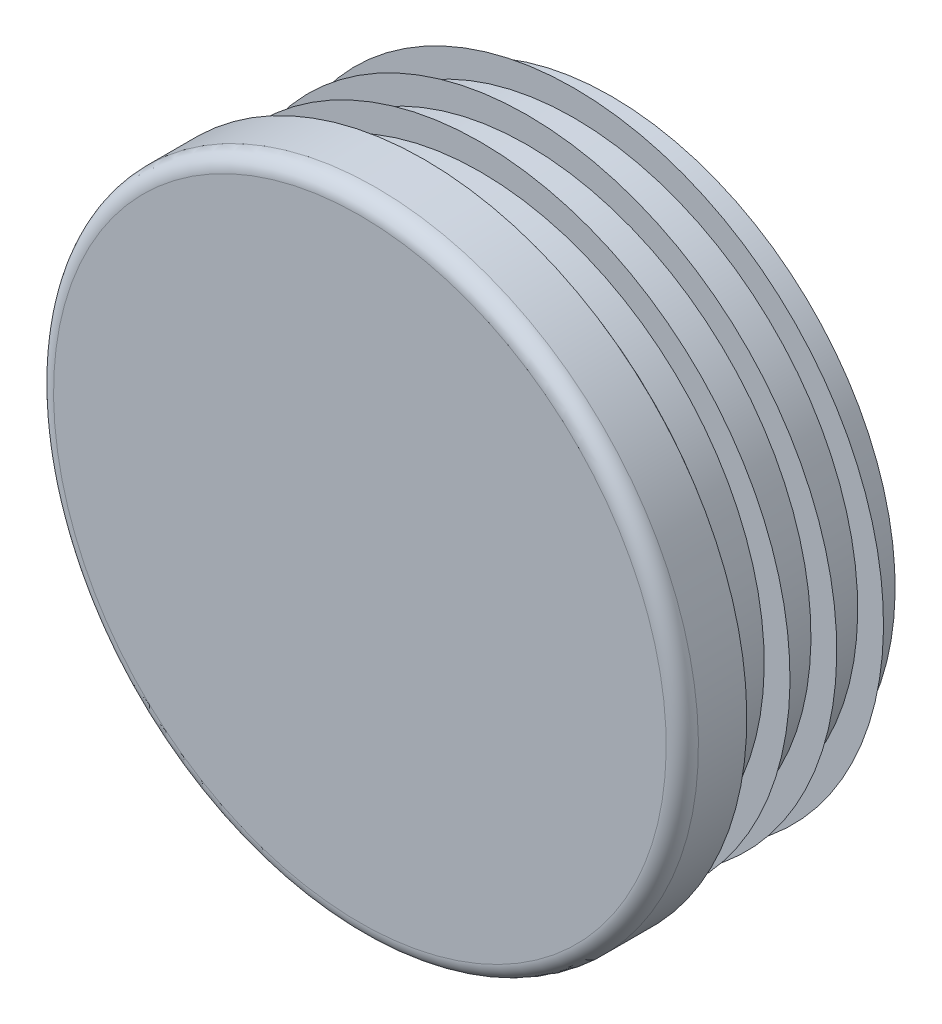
ISO-10303-21;
HEADER;
FILE_DESCRIPTION(('STEP AP214'),'2;1');
FILE_NAME('part.step','',(''),(''),'','','');
FILE_SCHEMA(('AUTOMOTIVE_DESIGN { 1 0 10303 214 1 1 1 1 }'));
ENDSEC;
DATA;
#1=APPLICATION_CONTEXT('core data for automotive mechanical design processes');
#2=APPLICATION_PROTOCOL_DEFINITION('international standard','automotive_design',2000,#1);
#3=PRODUCT_CONTEXT('',#1,'mechanical');
#4=PRODUCT('Part','Part','',(#3));
#5=PRODUCT_RELATED_PRODUCT_CATEGORY('part','',(#4));
#6=PRODUCT_DEFINITION_FORMATION('','',#4);
#7=PRODUCT_DEFINITION_CONTEXT('part definition',#1,'design');
#8=PRODUCT_DEFINITION('design','',#6,#7);
#9=PRODUCT_DEFINITION_SHAPE('','',#8);
#10=(LENGTH_UNIT() NAMED_UNIT(*) SI_UNIT(.MILLI.,.METRE.));
#11=(NAMED_UNIT(*) PLANE_ANGLE_UNIT() SI_UNIT($,.RADIAN.));
#12=(NAMED_UNIT(*) SI_UNIT($,.STERADIAN.) SOLID_ANGLE_UNIT());
#13=UNCERTAINTY_MEASURE_WITH_UNIT(LENGTH_MEASURE(1.E-05),#10,'distance_accuracy_value','');
#14=(GEOMETRIC_REPRESENTATION_CONTEXT(3) GLOBAL_UNCERTAINTY_ASSIGNED_CONTEXT((#13)) GLOBAL_UNIT_ASSIGNED_CONTEXT((#10,
#11,#12)) REPRESENTATION_CONTEXT('',''));
#15=CARTESIAN_POINT('',(0.,0.,0.));
#16=DIRECTION('',(0.,0.,1.));
#17=DIRECTION('',(1.,0.,0.));
#18=AXIS2_PLACEMENT_3D('',#15,#16,#17);
#19=CARTESIAN_POINT('',(0.,0.,5.));
#20=DIRECTION('',(0.,0.,-1.));
#21=DIRECTION('',(0.,1.,0.));
#22=AXIS2_PLACEMENT_3D('',#19,#20,#21);
#23=PLANE('',#22);
#24=CARTESIAN_POINT('',(0.,0.,5.));
#25=DIRECTION('',(0.,0.,-1.));
#26=DIRECTION('',(0.,1.,0.));
#27=AXIS2_PLACEMENT_3D('',#24,#25,#26);
#28=CIRCLE('',#27,23.75);
#29=CARTESIAN_POINT('',(0.,23.75,5.));
#30=VERTEX_POINT('',#29);
#31=EDGE_CURVE('E8',#30,#30,#28,.T.);
#32=ORIENTED_EDGE('',*,*,#31,.F.);
#33=EDGE_LOOP('',(#32));
#34=FACE_BOUND('',#33,.T.);
#35=ADVANCED_FACE('F12',(#34),#23,.F.);
#36=CARTESIAN_POINT('',(0.,0.,3.75));
#37=DIRECTION('',(0.,0.,-1.));
#38=DIRECTION('',(0.,1.,0.));
#39=AXIS2_PLACEMENT_3D('',#36,#37,#38);
#40=TOROIDAL_SURFACE('',#39,23.75,1.25);
#41=ORIENTED_EDGE('',*,*,#31,.T.);
#42=EDGE_LOOP('',(#41));
#43=FACE_BOUND('',#42,.T.);
#44=CARTESIAN_POINT('',(0.,0.,3.75));
#45=DIRECTION('',(0.,0.,-1.));
#46=DIRECTION('',(0.,1.,0.));
#47=AXIS2_PLACEMENT_3D('',#44,#45,#46);
#48=CIRCLE('',#47,25.);
#49=CARTESIAN_POINT('',(0.,25.,3.75));
#50=VERTEX_POINT('',#49);
#51=EDGE_CURVE('E18',#50,#50,#48,.T.);
#52=ORIENTED_EDGE('',*,*,#51,.F.);
#53=EDGE_LOOP('',(#52));
#54=FACE_BOUND('',#53,.T.);
#55=ADVANCED_FACE('F159',(#43,#54),#40,.T.);
#56=CARTESIAN_POINT('',(0.,0.,-14.5));
#57=DIRECTION('',(0.,0.,-1.));
#58=DIRECTION('',(0.,1.,0.));
#59=AXIS2_PLACEMENT_3D('',#56,#57,#58);
#60=CYLINDRICAL_SURFACE('',#59,25.);
#61=CARTESIAN_POINT('',(0.,0.,0.));
#62=DIRECTION('',(0.,0.,-1.));
#63=DIRECTION('',(0.,1.,0.));
#64=AXIS2_PLACEMENT_3D('',#61,#62,#63);
#65=CIRCLE('',#64,25.);
#66=CARTESIAN_POINT('',(0.,25.,0.));
#67=VERTEX_POINT('',#66);
#68=EDGE_CURVE('E22',#67,#67,#65,.T.);
#69=ORIENTED_EDGE('',*,*,#68,.F.);
#70=EDGE_LOOP('',(#69));
#71=FACE_BOUND('',#70,.T.);
#72=ORIENTED_EDGE('',*,*,#51,.T.);
#73=EDGE_LOOP('',(#72));
#74=FACE_BOUND('',#73,.T.);
#75=ADVANCED_FACE('F154',(#71,#74),#60,.T.);
#76=CARTESIAN_POINT('',(25.,0.,0.));
#77=DIRECTION('',(0.,0.,1.));
#78=DIRECTION('',(0.,-1.,0.));
#79=AXIS2_PLACEMENT_3D('',#76,#77,#78);
#80=PLANE('',#79);
#81=CARTESIAN_POINT('',(0.,0.,0.));
#82=DIRECTION('',(0.,0.,-1.));
#83=DIRECTION('',(0.,1.,0.));
#84=AXIS2_PLACEMENT_3D('',#81,#82,#83);
#85=CIRCLE('',#84,22.);
#86=CARTESIAN_POINT('',(0.,22.,0.));
#87=VERTEX_POINT('',#86);
#88=EDGE_CURVE('E26',#87,#87,#85,.T.);
#89=ORIENTED_EDGE('',*,*,#88,.F.);
#90=EDGE_LOOP('',(#89));
#91=FACE_BOUND('',#90,.T.);
#92=ORIENTED_EDGE('',*,*,#68,.T.);
#93=EDGE_LOOP('',(#92));
#94=FACE_BOUND('',#93,.T.);
#95=ADVANCED_FACE('F148',(#91,#94),#80,.F.);
#96=CARTESIAN_POINT('',(0.,0.,-14.5));
#97=DIRECTION('',(0.,0.,-1.));
#98=DIRECTION('',(0.,1.,0.));
#99=AXIS2_PLACEMENT_3D('',#96,#97,#98);
#100=CYLINDRICAL_SURFACE('',#99,22.);
#101=CARTESIAN_POINT('',(0.,0.,-0.725));
#102=DIRECTION('',(0.,0.,-1.));
#103=DIRECTION('',(0.,1.,0.));
#104=AXIS2_PLACEMENT_3D('',#101,#102,#103);
#105=CIRCLE('',#104,22.);
#106=CARTESIAN_POINT('',(0.,22.,-0.725));
#107=VERTEX_POINT('',#106);
#108=EDGE_CURVE('E31',#107,#107,#105,.T.);
#109=ORIENTED_EDGE('',*,*,#108,.F.);
#110=EDGE_LOOP('',(#109));
#111=FACE_BOUND('',#110,.T.);
#112=ORIENTED_EDGE('',*,*,#88,.T.);
#113=EDGE_LOOP('',(#112));
#114=FACE_BOUND('',#113,.T.);
#115=ADVANCED_FACE('F142',(#111,#114),#100,.T.);
#116=CARTESIAN_POINT('',(22.,0.,-0.725));
#117=DIRECTION('',(0.,0.,-1.));
#118=DIRECTION('',(0.,1.,0.));
#119=AXIS2_PLACEMENT_3D('',#116,#117,#118);
#120=PLANE('',#119);
#121=CARTESIAN_POINT('',(0.,0.,-0.725));
#122=DIRECTION('',(0.,0.,-1.));
#123=DIRECTION('',(0.,1.,0.));
#124=AXIS2_PLACEMENT_3D('',#121,#122,#123);
#125=CIRCLE('',#124,24.);
#126=CARTESIAN_POINT('',(0.,24.,-0.725));
#127=VERTEX_POINT('',#126);
#128=EDGE_CURVE('E34',#127,#127,#125,.T.);
#129=ORIENTED_EDGE('',*,*,#128,.F.);
#130=EDGE_LOOP('',(#129));
#131=FACE_BOUND('',#130,.T.);
#132=ORIENTED_EDGE('',*,*,#108,.T.);
#133=EDGE_LOOP('',(#132));
#134=FACE_BOUND('',#133,.T.);
#135=ADVANCED_FACE('F136',(#131,#134),#120,.F.);
#136=CARTESIAN_POINT('',(0.,0.,-0.725));
#137=DIRECTION('',(0.,0.,1.));
#138=DIRECTION('',(0.,-1.,0.));
#139=AXIS2_PLACEMENT_3D('',#136,#137,#138);
#140=CONICAL_SURFACE('',#139,24.,0.959931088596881);
#141=CARTESIAN_POINT('',(0.,0.,-2.12541507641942));
#142=DIRECTION('',(0.,0.,-1.));
#143=DIRECTION('',(0.,1.,0.));
#144=AXIS2_PLACEMENT_3D('',#141,#142,#143);
#145=CIRCLE('',#144,22.);
#146=CARTESIAN_POINT('',(0.,22.,-2.12541507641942));
#147=VERTEX_POINT('',#146);
#148=EDGE_CURVE('E37',#147,#147,#145,.T.);
#149=ORIENTED_EDGE('',*,*,#148,.F.);
#150=EDGE_LOOP('',(#149));
#151=FACE_BOUND('',#150,.T.);
#152=ORIENTED_EDGE('',*,*,#128,.T.);
#153=EDGE_LOOP('',(#152));
#154=FACE_BOUND('',#153,.T.);
#155=ADVANCED_FACE('F130',(#151,#154),#140,.T.);
#156=CARTESIAN_POINT('',(0.,0.,-14.5));
#157=DIRECTION('',(0.,0.,-1.));
#158=DIRECTION('',(0.,1.,0.));
#159=AXIS2_PLACEMENT_3D('',#156,#157,#158);
#160=CYLINDRICAL_SURFACE('',#159,22.);
#161=CARTESIAN_POINT('',(0.,0.,-4.35));
#162=DIRECTION('',(0.,0.,-1.));
#163=DIRECTION('',(0.,1.,0.));
#164=AXIS2_PLACEMENT_3D('',#161,#162,#163);
#165=CIRCLE('',#164,22.);
#166=CARTESIAN_POINT('',(0.,22.,-4.35));
#167=VERTEX_POINT('',#166);
#168=EDGE_CURVE('E40',#167,#167,#165,.T.);
#169=ORIENTED_EDGE('',*,*,#168,.F.);
#170=EDGE_LOOP('',(#169));
#171=FACE_BOUND('',#170,.T.);
#172=ORIENTED_EDGE('',*,*,#148,.T.);
#173=EDGE_LOOP('',(#172));
#174=FACE_BOUND('',#173,.T.);
#175=ADVANCED_FACE('F124',(#171,#174),#160,.T.);
#176=CARTESIAN_POINT('',(22.,0.,-4.35));
#177=DIRECTION('',(0.,0.,-1.));
#178=DIRECTION('',(0.,1.,0.));
#179=AXIS2_PLACEMENT_3D('',#176,#177,#178);
#180=PLANE('',#179);
#181=CARTESIAN_POINT('',(0.,0.,-4.35));
#182=DIRECTION('',(0.,0.,-1.));
#183=DIRECTION('',(0.,1.,0.));
#184=AXIS2_PLACEMENT_3D('',#181,#182,#183);
#185=CIRCLE('',#184,24.);
#186=CARTESIAN_POINT('',(0.,24.,-4.35));
#187=VERTEX_POINT('',#186);
#188=EDGE_CURVE('E43',#187,#187,#185,.T.);
#189=ORIENTED_EDGE('',*,*,#188,.F.);
#190=EDGE_LOOP('',(#189));
#191=FACE_BOUND('',#190,.T.);
#192=ORIENTED_EDGE('',*,*,#168,.T.);
#193=EDGE_LOOP('',(#192));
#194=FACE_BOUND('',#193,.T.);
#195=ADVANCED_FACE('F118',(#191,#194),#180,.F.);
#196=CARTESIAN_POINT('',(0.,0.,-4.35));
#197=DIRECTION('',(0.,0.,1.));
#198=DIRECTION('',(0.,-1.,0.));
#199=AXIS2_PLACEMENT_3D('',#196,#197,#198);
#200=CONICAL_SURFACE('',#199,24.,0.959931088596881);
#201=CARTESIAN_POINT('',(0.,0.,-5.75041507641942));
#202=DIRECTION('',(0.,0.,-1.));
#203=DIRECTION('',(0.,1.,0.));
#204=AXIS2_PLACEMENT_3D('',#201,#202,#203);
#205=CIRCLE('',#204,22.);
#206=CARTESIAN_POINT('',(0.,22.,-5.75041507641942));
#207=VERTEX_POINT('',#206);
#208=EDGE_CURVE('E46',#207,#207,#205,.T.);
#209=ORIENTED_EDGE('',*,*,#208,.F.);
#210=EDGE_LOOP('',(#209));
#211=FACE_BOUND('',#210,.T.);
#212=ORIENTED_EDGE('',*,*,#188,.T.);
#213=EDGE_LOOP('',(#212));
#214=FACE_BOUND('',#213,.T.);
#215=ADVANCED_FACE('F112',(#211,#214),#200,.T.);
#216=CARTESIAN_POINT('',(0.,0.,-14.5));
#217=DIRECTION('',(0.,0.,-1.));
#218=DIRECTION('',(0.,1.,0.));
#219=AXIS2_PLACEMENT_3D('',#216,#217,#218);
#220=CYLINDRICAL_SURFACE('',#219,22.);
#221=CARTESIAN_POINT('',(0.,0.,-7.975));
#222=DIRECTION('',(0.,0.,-1.));
#223=DIRECTION('',(0.,1.,0.));
#224=AXIS2_PLACEMENT_3D('',#221,#222,#223);
#225=CIRCLE('',#224,22.);
#226=CARTESIAN_POINT('',(0.,22.,-7.975));
#227=VERTEX_POINT('',#226);
#228=EDGE_CURVE('E49',#227,#227,#225,.T.);
#229=ORIENTED_EDGE('',*,*,#228,.F.);
#230=EDGE_LOOP('',(#229));
#231=FACE_BOUND('',#230,.T.);
#232=ORIENTED_EDGE('',*,*,#208,.T.);
#233=EDGE_LOOP('',(#232));
#234=FACE_BOUND('',#233,.T.);
#235=ADVANCED_FACE('F106',(#231,#234),#220,.T.);
#236=CARTESIAN_POINT('',(22.,0.,-7.975));
#237=DIRECTION('',(0.,0.,-1.));
#238=DIRECTION('',(0.,1.,0.));
#239=AXIS2_PLACEMENT_3D('',#236,#237,#238);
#240=PLANE('',#239);
#241=CARTESIAN_POINT('',(0.,0.,-7.975));
#242=DIRECTION('',(0.,0.,-1.));
#243=DIRECTION('',(0.,1.,0.));
#244=AXIS2_PLACEMENT_3D('',#241,#242,#243);
#245=CIRCLE('',#244,24.);
#246=CARTESIAN_POINT('',(0.,24.,-7.975));
#247=VERTEX_POINT('',#246);
#248=EDGE_CURVE('E52',#247,#247,#245,.T.);
#249=ORIENTED_EDGE('',*,*,#248,.F.);
#250=EDGE_LOOP('',(#249));
#251=FACE_BOUND('',#250,.T.);
#252=ORIENTED_EDGE('',*,*,#228,.T.);
#253=EDGE_LOOP('',(#252));
#254=FACE_BOUND('',#253,.T.);
#255=ADVANCED_FACE('F100',(#251,#254),#240,.F.);
#256=CARTESIAN_POINT('',(0.,0.,-7.975));
#257=DIRECTION('',(0.,0.,1.));
#258=DIRECTION('',(0.,-1.,0.));
#259=AXIS2_PLACEMENT_3D('',#256,#257,#258);
#260=CONICAL_SURFACE('',#259,24.,0.959931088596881);
#261=CARTESIAN_POINT('',(0.,0.,-9.37541507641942));
#262=DIRECTION('',(0.,0.,-1.));
#263=DIRECTION('',(0.,1.,0.));
#264=AXIS2_PLACEMENT_3D('',#261,#262,#263);
#265=CIRCLE('',#264,22.);
#266=CARTESIAN_POINT('',(0.,22.,-9.37541507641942));
#267=VERTEX_POINT('',#266);
#268=EDGE_CURVE('E55',#267,#267,#265,.T.);
#269=ORIENTED_EDGE('',*,*,#268,.F.);
#270=EDGE_LOOP('',(#269));
#271=FACE_BOUND('',#270,.T.);
#272=ORIENTED_EDGE('',*,*,#248,.T.);
#273=EDGE_LOOP('',(#272));
#274=FACE_BOUND('',#273,.T.);
#275=ADVANCED_FACE('F94',(#271,#274),#260,.T.);
#276=CARTESIAN_POINT('',(0.,0.,-14.5));
#277=DIRECTION('',(0.,0.,-1.));
#278=DIRECTION('',(0.,1.,0.));
#279=AXIS2_PLACEMENT_3D('',#276,#277,#278);
#280=CYLINDRICAL_SURFACE('',#279,22.);
#281=CARTESIAN_POINT('',(0.,0.,-11.6));
#282=DIRECTION('',(0.,0.,-1.));
#283=DIRECTION('',(0.,1.,0.));
#284=AXIS2_PLACEMENT_3D('',#281,#282,#283);
#285=CIRCLE('',#284,22.);
#286=CARTESIAN_POINT('',(0.,22.,-11.6));
#287=VERTEX_POINT('',#286);
#288=EDGE_CURVE('E58',#287,#287,#285,.T.);
#289=ORIENTED_EDGE('',*,*,#288,.F.);
#290=EDGE_LOOP('',(#289));
#291=FACE_BOUND('',#290,.T.);
#292=ORIENTED_EDGE('',*,*,#268,.T.);
#293=EDGE_LOOP('',(#292));
#294=FACE_BOUND('',#293,.T.);
#295=ADVANCED_FACE('F88',(#291,#294),#280,.T.);
#296=CARTESIAN_POINT('',(22.,0.,-11.6));
#297=DIRECTION('',(0.,0.,-1.));
#298=DIRECTION('',(0.,1.,0.));
#299=AXIS2_PLACEMENT_3D('',#296,#297,#298);
#300=PLANE('',#299);
#301=CARTESIAN_POINT('',(0.,0.,-11.6));
#302=DIRECTION('',(0.,0.,-1.));
#303=DIRECTION('',(0.,1.,0.));
#304=AXIS2_PLACEMENT_3D('',#301,#302,#303);
#305=CIRCLE('',#304,24.);
#306=CARTESIAN_POINT('',(0.,24.,-11.6));
#307=VERTEX_POINT('',#306);
#308=EDGE_CURVE('E61',#307,#307,#305,.T.);
#309=ORIENTED_EDGE('',*,*,#308,.F.);
#310=EDGE_LOOP('',(#309));
#311=FACE_BOUND('',#310,.T.);
#312=ORIENTED_EDGE('',*,*,#288,.T.);
#313=EDGE_LOOP('',(#312));
#314=FACE_BOUND('',#313,.T.);
#315=ADVANCED_FACE('F82',(#311,#314),#300,.F.);
#316=CARTESIAN_POINT('',(0.,0.,-11.6));
#317=DIRECTION('',(0.,0.,1.));
#318=DIRECTION('',(0.,-1.,0.));
#319=AXIS2_PLACEMENT_3D('',#316,#317,#318);
#320=CONICAL_SURFACE('',#319,24.,0.959931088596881);
#321=CARTESIAN_POINT('',(0.,0.,-13.0004150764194));
#322=DIRECTION('',(0.,0.,-1.));
#323=DIRECTION('',(0.,1.,0.));
#324=AXIS2_PLACEMENT_3D('',#321,#322,#323);
#325=CIRCLE('',#324,22.);
#326=CARTESIAN_POINT('',(0.,22.,-13.0004150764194));
#327=VERTEX_POINT('',#326);
#328=EDGE_CURVE('E64',#327,#327,#325,.T.);
#329=ORIENTED_EDGE('',*,*,#328,.F.);
#330=EDGE_LOOP('',(#329));
#331=FACE_BOUND('',#330,.T.);
#332=ORIENTED_EDGE('',*,*,#308,.T.);
#333=EDGE_LOOP('',(#332));
#334=FACE_BOUND('',#333,.T.);
#335=ADVANCED_FACE('F76',(#331,#334),#320,.T.);
#336=CARTESIAN_POINT('',(0.,0.,-14.5));
#337=DIRECTION('',(0.,0.,-1.));
#338=DIRECTION('',(0.,1.,0.));
#339=AXIS2_PLACEMENT_3D('',#336,#337,#338);
#340=CYLINDRICAL_SURFACE('',#339,22.);
#341=CARTESIAN_POINT('',(0.,0.,-14.5));
#342=DIRECTION('',(0.,0.,-1.));
#343=DIRECTION('',(0.,1.,0.));
#344=AXIS2_PLACEMENT_3D('',#341,#342,#343);
#345=CIRCLE('',#344,22.);
#346=CARTESIAN_POINT('',(0.,22.,-14.5));
#347=VERTEX_POINT('',#346);
#348=EDGE_CURVE('E67',#347,#347,#345,.T.);
#349=ORIENTED_EDGE('',*,*,#348,.F.);
#350=EDGE_LOOP('',(#349));
#351=FACE_BOUND('',#350,.T.);
#352=ORIENTED_EDGE('',*,*,#328,.T.);
#353=EDGE_LOOP('',(#352));
#354=FACE_BOUND('',#353,.T.);
#355=ADVANCED_FACE('F73',(#351,#354),#340,.T.);
#356=CARTESIAN_POINT('',(22.,0.,-14.5));
#357=DIRECTION('',(0.,0.,1.));
#358=DIRECTION('',(0.,-1.,0.));
#359=AXIS2_PLACEMENT_3D('',#356,#357,#358);
#360=PLANE('',#359);
#361=ORIENTED_EDGE('',*,*,#348,.T.);
#362=EDGE_LOOP('',(#361));
#363=FACE_BOUND('',#362,.T.);
#364=ADVANCED_FACE('F71',(#363),#360,.F.);
#365=CLOSED_SHELL('',(#35,#55,#75,#95,#115,#135,#155,#175,#195,#215,#235,#255,#275,#295,#315,
#335,#355,#364));
#366=MANIFOLD_SOLID_BREP('B1',#365);
#367=ADVANCED_BREP_SHAPE_REPRESENTATION('',(#18,#366),#14);
#368=SHAPE_DEFINITION_REPRESENTATION(#9,#367);
ENDSEC;
END-ISO-10303-21;
